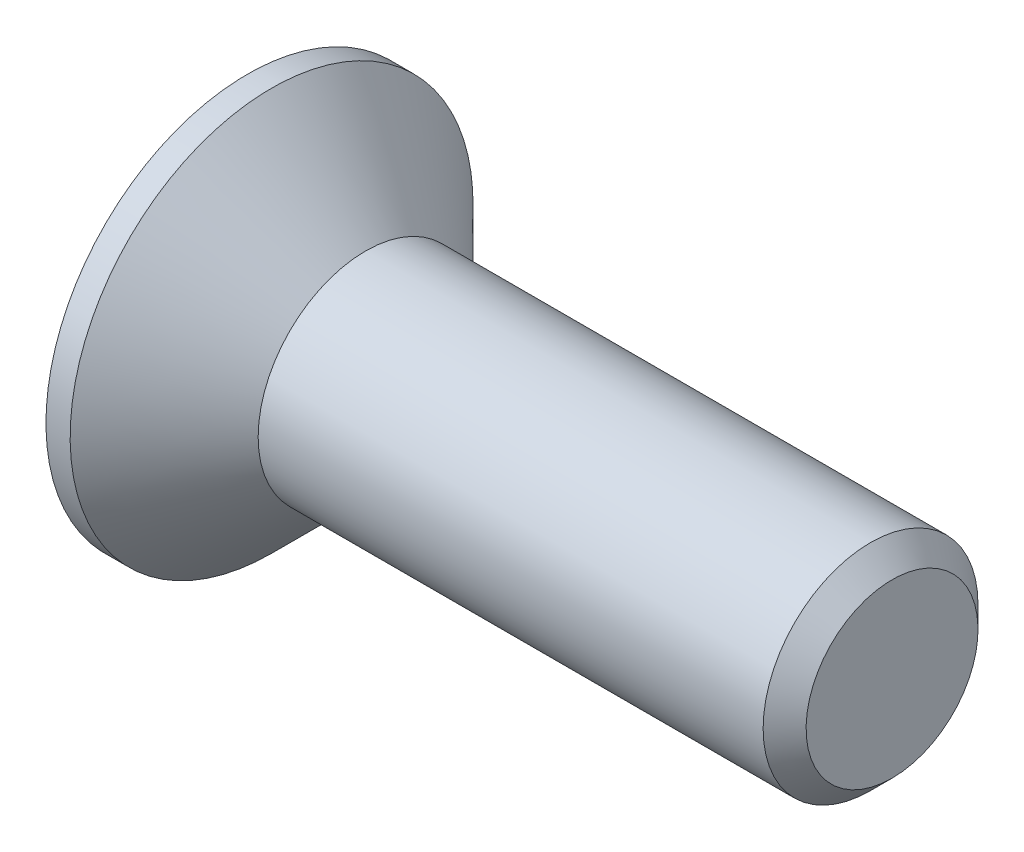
ISO-10303-21;
HEADER;
FILE_DESCRIPTION(('STEP AP214'),'2;1');
FILE_NAME('part.step','',(''),(''),'','','');
FILE_SCHEMA(('AUTOMOTIVE_DESIGN { 1 0 10303 214 1 1 1 1 }'));
ENDSEC;
DATA;
#1=APPLICATION_CONTEXT('core data for automotive mechanical design processes');
#2=APPLICATION_PROTOCOL_DEFINITION('international standard','automotive_design',2000,#1);
#3=PRODUCT_CONTEXT('',#1,'mechanical');
#4=PRODUCT('Part','Part','',(#3));
#5=PRODUCT_RELATED_PRODUCT_CATEGORY('part','',(#4));
#6=PRODUCT_DEFINITION_FORMATION('','',#4);
#7=PRODUCT_DEFINITION_CONTEXT('part definition',#1,'design');
#8=PRODUCT_DEFINITION('design','',#6,#7);
#9=PRODUCT_DEFINITION_SHAPE('','',#8);
#10=(LENGTH_UNIT() NAMED_UNIT(*) SI_UNIT(.MILLI.,.METRE.));
#11=(NAMED_UNIT(*) PLANE_ANGLE_UNIT() SI_UNIT($,.RADIAN.));
#12=(NAMED_UNIT(*) SI_UNIT($,.STERADIAN.) SOLID_ANGLE_UNIT());
#13=UNCERTAINTY_MEASURE_WITH_UNIT(LENGTH_MEASURE(1.E-05),#10,'distance_accuracy_value','');
#14=(GEOMETRIC_REPRESENTATION_CONTEXT(3) GLOBAL_UNCERTAINTY_ASSIGNED_CONTEXT((#13)) GLOBAL_UNIT_ASSIGNED_CONTEXT((#10,
#11,#12)) REPRESENTATION_CONTEXT('',''));
#15=CARTESIAN_POINT('',(0.,0.,0.));
#16=DIRECTION('',(0.,0.,1.));
#17=DIRECTION('',(1.,0.,0.));
#18=AXIS2_PLACEMENT_3D('',#15,#16,#17);
#19=CARTESIAN_POINT('',(0.,0.,0.));
#20=DIRECTION('',(-1.,0.,0.));
#21=DIRECTION('',(0.,-1.,0.));
#22=AXIS2_PLACEMENT_3D('',#19,#20,#21);
#23=CONICAL_SURFACE('',#22,2.,0.78539816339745);
#24=CARTESIAN_POINT('',(-1.74999999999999,0.,0.));
#25=DIRECTION('',(-1.,0.,0.));
#26=DIRECTION('',(0.,-1.,0.));
#27=AXIS2_PLACEMENT_3D('',#24,#25,#26);
#28=CIRCLE('',#27,3.75);
#29=CARTESIAN_POINT('',(-1.74999999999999,-3.75,0.));
#30=VERTEX_POINT('',#29);
#31=EDGE_CURVE('E189',#30,#30,#28,.T.);
#32=ORIENTED_EDGE('',*,*,#31,.F.);
#33=EDGE_LOOP('',(#32));
#34=FACE_BOUND('',#33,.T.);
#35=CARTESIAN_POINT('',(0.,0.,0.));
#36=DIRECTION('',(-1.,0.,0.));
#37=DIRECTION('',(0.,-1.,0.));
#38=AXIS2_PLACEMENT_3D('',#35,#36,#37);
#39=CIRCLE('',#38,2.);
#40=CARTESIAN_POINT('',(0.,-2.,0.));
#41=VERTEX_POINT('',#40);
#42=EDGE_CURVE('E212',#41,#41,#39,.T.);
#43=ORIENTED_EDGE('',*,*,#42,.T.);
#44=EDGE_LOOP('',(#43));
#45=FACE_BOUND('',#44,.T.);
#46=ADVANCED_FACE('F33',(#34,#45),#23,.T.);
#47=CARTESIAN_POINT('',(-2.2,0.,0.));
#48=DIRECTION('',(-1.,0.,0.));
#49=DIRECTION('',(0.,-1.,0.));
#50=AXIS2_PLACEMENT_3D('',#47,#48,#49);
#51=CYLINDRICAL_SURFACE('',#50,2.);
#52=CARTESIAN_POINT('',(9.4,0.,0.));
#53=DIRECTION('',(-1.,0.,0.));
#54=DIRECTION('',(0.,-1.,0.));
#55=AXIS2_PLACEMENT_3D('',#52,#53,#54);
#56=CIRCLE('',#55,2.);
#57=CARTESIAN_POINT('',(9.4,-2.,0.));
#58=VERTEX_POINT('',#57);
#59=EDGE_CURVE('E41',#58,#58,#56,.T.);
#60=ORIENTED_EDGE('',*,*,#59,.T.);
#61=EDGE_LOOP('',(#60));
#62=FACE_BOUND('',#61,.T.);
#63=ORIENTED_EDGE('',*,*,#42,.F.);
#64=EDGE_LOOP('',(#63));
#65=FACE_BOUND('',#64,.T.);
#66=ADVANCED_FACE('F217',(#62,#65),#51,.T.);
#67=CARTESIAN_POINT('',(9.8,0.,0.));
#68=DIRECTION('',(-1.,0.,0.));
#69=DIRECTION('',(0.,-1.,0.));
#70=AXIS2_PLACEMENT_3D('',#67,#68,#69);
#71=PLANE('',#70);
#72=CARTESIAN_POINT('',(9.8,0.,0.));
#73=DIRECTION('',(-1.,0.,0.));
#74=DIRECTION('',(0.,-1.,0.));
#75=AXIS2_PLACEMENT_3D('',#72,#73,#74);
#76=CIRCLE('',#75,1.6);
#77=CARTESIAN_POINT('',(9.8,-1.6,0.));
#78=VERTEX_POINT('',#77);
#79=EDGE_CURVE('E11',#78,#78,#76,.F.);
#80=ORIENTED_EDGE('',*,*,#79,.T.);
#81=EDGE_LOOP('',(#80));
#82=FACE_BOUND('',#81,.T.);
#83=ADVANCED_FACE('F239',(#82),#71,.F.);
#84=CARTESIAN_POINT('',(-2.2,3.75,0.));
#85=DIRECTION('',(1.,0.,0.));
#86=DIRECTION('',(0.,1.,0.));
#87=AXIS2_PLACEMENT_3D('',#84,#85,#86);
#88=PLANE('',#87);
#89=DIRECTION('',(0.,0.,-1.));
#90=VECTOR('',#89,1.);
#91=CARTESIAN_POINT('',(-2.2,0.55,-2.2));
#92=LINE('',#91,#90);
#93=CARTESIAN_POINT('',(-2.2,0.55,-0.55));
#94=VERTEX_POINT('',#93);
#95=CARTESIAN_POINT('',(-2.2,0.55,-2.2));
#96=VERTEX_POINT('',#95);
#97=EDGE_CURVE('E158',#94,#96,#92,.T.);
#98=ORIENTED_EDGE('',*,*,#97,.F.);
#99=DIRECTION('',(0.,-1.,0.));
#100=VECTOR('',#99,1.);
#101=CARTESIAN_POINT('',(-2.2,0.55,-0.55));
#102=LINE('',#101,#100);
#103=CARTESIAN_POINT('',(-2.2,2.2,-0.55));
#104=VERTEX_POINT('',#103);
#105=EDGE_CURVE('E48',#104,#94,#102,.T.);
#106=ORIENTED_EDGE('',*,*,#105,.F.);
#107=DIRECTION('',(0.,0.,-1.));
#108=VECTOR('',#107,1.);
#109=CARTESIAN_POINT('',(-2.2,2.2,-0.55));
#110=LINE('',#109,#108);
#111=CARTESIAN_POINT('',(-2.2,2.2,0.55));
#112=VERTEX_POINT('',#111);
#113=EDGE_CURVE('E185',#112,#104,#110,.T.);
#114=ORIENTED_EDGE('',*,*,#113,.F.);
#115=DIRECTION('',(0.,1.,0.));
#116=VECTOR('',#115,1.);
#117=CARTESIAN_POINT('',(-2.2,2.2,0.55));
#118=LINE('',#117,#116);
#119=CARTESIAN_POINT('',(-2.2,0.55,0.55));
#120=VERTEX_POINT('',#119);
#121=EDGE_CURVE('E183',#120,#112,#118,.T.);
#122=ORIENTED_EDGE('',*,*,#121,.F.);
#123=DIRECTION('',(0.,0.,-1.));
#124=VECTOR('',#123,1.);
#125=CARTESIAN_POINT('',(-2.2,0.55,0.55));
#126=LINE('',#125,#124);
#127=CARTESIAN_POINT('',(-2.2,0.55,2.2));
#128=VERTEX_POINT('',#127);
#129=EDGE_CURVE('E132',#128,#120,#126,.T.);
#130=ORIENTED_EDGE('',*,*,#129,.F.);
#131=DIRECTION('',(0.,1.,0.));
#132=VECTOR('',#131,1.);
#133=CARTESIAN_POINT('',(-2.2,0.55,2.2));
#134=LINE('',#133,#132);
#135=CARTESIAN_POINT('',(-2.2,-0.55,2.2));
#136=VERTEX_POINT('',#135);
#137=EDGE_CURVE('E179',#136,#128,#134,.T.);
#138=ORIENTED_EDGE('',*,*,#137,.F.);
#139=DIRECTION('',(0.,0.,1.));
#140=VECTOR('',#139,1.);
#141=CARTESIAN_POINT('',(-2.2,-0.55,2.2));
#142=LINE('',#141,#140);
#143=CARTESIAN_POINT('',(-2.2,-0.55,0.55));
#144=VERTEX_POINT('',#143);
#145=EDGE_CURVE('E176',#144,#136,#142,.T.);
#146=ORIENTED_EDGE('',*,*,#145,.F.);
#147=DIRECTION('',(0.,1.,0.));
#148=VECTOR('',#147,1.);
#149=CARTESIAN_POINT('',(-2.2,-0.55,0.55));
#150=LINE('',#149,#148);
#151=CARTESIAN_POINT('',(-2.2,-2.2,0.55));
#152=VERTEX_POINT('',#151);
#153=EDGE_CURVE('E173',#152,#144,#150,.T.);
#154=ORIENTED_EDGE('',*,*,#153,.F.);
#155=DIRECTION('',(0.,0.,1.));
#156=VECTOR('',#155,1.);
#157=CARTESIAN_POINT('',(-2.2,-2.2,0.55));
#158=LINE('',#157,#156);
#159=CARTESIAN_POINT('',(-2.2,-2.2,-0.55));
#160=VERTEX_POINT('',#159);
#161=EDGE_CURVE('E170',#160,#152,#158,.T.);
#162=ORIENTED_EDGE('',*,*,#161,.F.);
#163=DIRECTION('',(0.,-1.,0.));
#164=VECTOR('',#163,1.);
#165=CARTESIAN_POINT('',(-2.2,-2.2,-0.55));
#166=LINE('',#165,#164);
#167=CARTESIAN_POINT('',(-2.2,-0.55,-0.55));
#168=VERTEX_POINT('',#167);
#169=EDGE_CURVE('E167',#168,#160,#166,.T.);
#170=ORIENTED_EDGE('',*,*,#169,.F.);
#171=DIRECTION('',(0.,0.,1.));
#172=VECTOR('',#171,1.);
#173=CARTESIAN_POINT('',(-2.2,-0.55,-0.55));
#174=LINE('',#173,#172);
#175=CARTESIAN_POINT('',(-2.2,-0.55,-2.2));
#176=VERTEX_POINT('',#175);
#177=EDGE_CURVE('E164',#176,#168,#174,.T.);
#178=ORIENTED_EDGE('',*,*,#177,.F.);
#179=DIRECTION('',(0.,-1.,0.));
#180=VECTOR('',#179,1.);
#181=CARTESIAN_POINT('',(-2.2,-0.55,-2.2));
#182=LINE('',#181,#180);
#183=EDGE_CURVE('E161',#96,#176,#182,.T.);
#184=ORIENTED_EDGE('',*,*,#183,.F.);
#185=EDGE_LOOP('',(#98,#106,#114,#122,#130,#138,#146,#154,#162,#170,#178,#184));
#186=FACE_BOUND('',#185,.T.);
#187=CARTESIAN_POINT('',(-2.2,0.,0.));
#188=DIRECTION('',(-1.,0.,0.));
#189=DIRECTION('',(0.,-1.,0.));
#190=AXIS2_PLACEMENT_3D('',#187,#188,#189);
#191=CIRCLE('',#190,3.75);
#192=CARTESIAN_POINT('',(-2.2,-3.75,0.));
#193=VERTEX_POINT('',#192);
#194=EDGE_CURVE('E209',#193,#193,#191,.T.);
#195=ORIENTED_EDGE('',*,*,#194,.T.);
#196=EDGE_LOOP('',(#195));
#197=FACE_BOUND('',#196,.T.);
#198=ADVANCED_FACE('F230',(#186,#197),#88,.F.);
#199=CARTESIAN_POINT('',(-2.2,0.,0.));
#200=DIRECTION('',(-1.,0.,0.));
#201=DIRECTION('',(0.,-1.,0.));
#202=AXIS2_PLACEMENT_3D('',#199,#200,#201);
#203=CYLINDRICAL_SURFACE('',#202,3.75);
#204=ORIENTED_EDGE('',*,*,#194,.F.);
#205=EDGE_LOOP('',(#204));
#206=FACE_BOUND('',#205,.T.);
#207=ORIENTED_EDGE('',*,*,#31,.T.);
#208=EDGE_LOOP('',(#207));
#209=FACE_BOUND('',#208,.T.);
#210=ADVANCED_FACE('F222',(#206,#209),#203,.T.);
#211=CARTESIAN_POINT('',(9.4,0.,0.));
#212=DIRECTION('',(-1.,0.,0.));
#213=DIRECTION('',(0.,-1.,0.));
#214=AXIS2_PLACEMENT_3D('',#211,#212,#213);
#215=CONICAL_SURFACE('',#214,2.,0.785398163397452);
#216=ORIENTED_EDGE('',*,*,#79,.F.);
#217=EDGE_LOOP('',(#216));
#218=FACE_BOUND('',#217,.T.);
#219=ORIENTED_EDGE('',*,*,#59,.F.);
#220=EDGE_LOOP('',(#219));
#221=FACE_BOUND('',#220,.T.);
#222=ADVANCED_FACE('F35',(#218,#221),#215,.T.);
#223=CARTESIAN_POINT('',(-0.3,0.55,-0.55));
#224=DIRECTION('',(0.,0.,-1.));
#225=DIRECTION('',(-1.,0.,0.));
#226=AXIS2_PLACEMENT_3D('',#223,#224,#225);
#227=PLANE('',#226);
#228=ORIENTED_EDGE('',*,*,#105,.T.);
#229=DIRECTION('',(-1.,0.,0.));
#230=VECTOR('',#229,1.);
#231=CARTESIAN_POINT('',(-0.3,0.55,-0.55));
#232=LINE('',#231,#230);
#233=CARTESIAN_POINT('',(-0.3,0.55,-0.55));
#234=VERTEX_POINT('',#233);
#235=EDGE_CURVE('E96',#234,#94,#232,.T.);
#236=ORIENTED_EDGE('',*,*,#235,.F.);
#237=DIRECTION('',(0.,-1.,0.));
#238=VECTOR('',#237,1.);
#239=CARTESIAN_POINT('',(-0.3,0.55,-0.55));
#240=LINE('',#239,#238);
#241=CARTESIAN_POINT('',(-0.3,2.2,-0.55));
#242=VERTEX_POINT('',#241);
#243=EDGE_CURVE('E187',#242,#234,#240,.T.);
#244=ORIENTED_EDGE('',*,*,#243,.F.);
#245=DIRECTION('',(-1.,0.,0.));
#246=VECTOR('',#245,1.);
#247=CARTESIAN_POINT('',(-0.3,2.2,-0.55));
#248=LINE('',#247,#246);
#249=EDGE_CURVE('E56',#242,#104,#248,.T.);
#250=ORIENTED_EDGE('',*,*,#249,.T.);
#251=EDGE_LOOP('',(#228,#236,#244,#250));
#252=FACE_BOUND('',#251,.T.);
#253=ADVANCED_FACE('F221',(#252),#227,.F.);
#254=CARTESIAN_POINT('',(-0.3,2.2,-0.55));
#255=DIRECTION('',(0.,1.,0.));
#256=DIRECTION('',(-1.,0.,0.));
#257=AXIS2_PLACEMENT_3D('',#254,#255,#256);
#258=PLANE('',#257);
#259=ORIENTED_EDGE('',*,*,#113,.T.);
#260=ORIENTED_EDGE('',*,*,#249,.F.);
#261=DIRECTION('',(0.,0.,-1.));
#262=VECTOR('',#261,1.);
#263=CARTESIAN_POINT('',(-0.3,2.2,-0.55));
#264=LINE('',#263,#262);
#265=CARTESIAN_POINT('',(-0.3,2.2,0.55));
#266=VERTEX_POINT('',#265);
#267=EDGE_CURVE('E144',#266,#242,#264,.T.);
#268=ORIENTED_EDGE('',*,*,#267,.F.);
#269=DIRECTION('',(-1.,0.,0.));
#270=VECTOR('',#269,1.);
#271=CARTESIAN_POINT('',(-0.3,2.2,0.55));
#272=LINE('',#271,#270);
#273=EDGE_CURVE('E136',#266,#112,#272,.T.);
#274=ORIENTED_EDGE('',*,*,#273,.T.);
#275=EDGE_LOOP('',(#259,#260,#268,#274));
#276=FACE_BOUND('',#275,.T.);
#277=ADVANCED_FACE('F228',(#276),#258,.F.);
#278=CARTESIAN_POINT('',(-0.3,2.2,0.55));
#279=DIRECTION('',(0.,0.,1.));
#280=DIRECTION('',(1.,0.,0.));
#281=AXIS2_PLACEMENT_3D('',#278,#279,#280);
#282=PLANE('',#281);
#283=ORIENTED_EDGE('',*,*,#121,.T.);
#284=ORIENTED_EDGE('',*,*,#273,.F.);
#285=DIRECTION('',(0.,1.,0.));
#286=VECTOR('',#285,1.);
#287=CARTESIAN_POINT('',(-0.3,2.2,0.55));
#288=LINE('',#287,#286);
#289=CARTESIAN_POINT('',(-0.3,0.55,0.55));
#290=VERTEX_POINT('',#289);
#291=EDGE_CURVE('E140',#290,#266,#288,.T.);
#292=ORIENTED_EDGE('',*,*,#291,.F.);
#293=DIRECTION('',(-1.,0.,0.));
#294=VECTOR('',#293,1.);
#295=CARTESIAN_POINT('',(-0.3,0.55,0.55));
#296=LINE('',#295,#294);
#297=EDGE_CURVE('E125',#290,#120,#296,.T.);
#298=ORIENTED_EDGE('',*,*,#297,.T.);
#299=EDGE_LOOP('',(#283,#284,#292,#298));
#300=FACE_BOUND('',#299,.T.);
#301=ADVANCED_FACE('F141',(#300),#282,.F.);
#302=CARTESIAN_POINT('',(-0.3,0.55,0.55));
#303=DIRECTION('',(0.,1.,0.));
#304=DIRECTION('',(-1.,0.,0.));
#305=AXIS2_PLACEMENT_3D('',#302,#303,#304);
#306=PLANE('',#305);
#307=ORIENTED_EDGE('',*,*,#129,.T.);
#308=ORIENTED_EDGE('',*,*,#297,.F.);
#309=DIRECTION('',(0.,0.,-1.));
#310=VECTOR('',#309,1.);
#311=CARTESIAN_POINT('',(-0.3,0.55,0.55));
#312=LINE('',#311,#310);
#313=CARTESIAN_POINT('',(-0.3,0.55,2.2));
#314=VERTEX_POINT('',#313);
#315=EDGE_CURVE('E129',#314,#290,#312,.T.);
#316=ORIENTED_EDGE('',*,*,#315,.F.);
#317=DIRECTION('',(-1.,0.,0.));
#318=VECTOR('',#317,1.);
#319=CARTESIAN_POINT('',(-0.3,0.55,2.2));
#320=LINE('',#319,#318);
#321=EDGE_CURVE('E137',#314,#128,#320,.T.);
#322=ORIENTED_EDGE('',*,*,#321,.T.);
#323=EDGE_LOOP('',(#307,#308,#316,#322));
#324=FACE_BOUND('',#323,.T.);
#325=ADVANCED_FACE('F127',(#324),#306,.F.);
#326=CARTESIAN_POINT('',(-0.3,0.55,2.2));
#327=DIRECTION('',(0.,0.,1.));
#328=DIRECTION('',(1.,0.,0.));
#329=AXIS2_PLACEMENT_3D('',#326,#327,#328);
#330=PLANE('',#329);
#331=ORIENTED_EDGE('',*,*,#137,.T.);
#332=ORIENTED_EDGE('',*,*,#321,.F.);
#333=DIRECTION('',(0.,1.,0.));
#334=VECTOR('',#333,1.);
#335=CARTESIAN_POINT('',(-0.3,0.55,2.2));
#336=LINE('',#335,#334);
#337=CARTESIAN_POINT('',(-0.3,-0.55,2.2));
#338=VERTEX_POINT('',#337);
#339=EDGE_CURVE('E150',#338,#314,#336,.T.);
#340=ORIENTED_EDGE('',*,*,#339,.F.);
#341=DIRECTION('',(-1.,0.,0.));
#342=VECTOR('',#341,1.);
#343=CARTESIAN_POINT('',(-0.3,-0.55,2.2));
#344=LINE('',#343,#342);
#345=EDGE_CURVE('E192',#338,#136,#344,.T.);
#346=ORIENTED_EDGE('',*,*,#345,.T.);
#347=EDGE_LOOP('',(#331,#332,#340,#346));
#348=FACE_BOUND('',#347,.T.);
#349=ADVANCED_FACE('F277',(#348),#330,.F.);
#350=CARTESIAN_POINT('',(-0.3,-0.55,2.2));
#351=DIRECTION('',(0.,-1.,0.));
#352=DIRECTION('',(1.,0.,0.));
#353=AXIS2_PLACEMENT_3D('',#350,#351,#352);
#354=PLANE('',#353);
#355=ORIENTED_EDGE('',*,*,#145,.T.);
#356=ORIENTED_EDGE('',*,*,#345,.F.);
#357=DIRECTION('',(0.,0.,1.));
#358=VECTOR('',#357,1.);
#359=CARTESIAN_POINT('',(-0.3,-0.55,2.2));
#360=LINE('',#359,#358);
#361=CARTESIAN_POINT('',(-0.3,-0.55,0.55));
#362=VERTEX_POINT('',#361);
#363=EDGE_CURVE('E152',#362,#338,#360,.T.);
#364=ORIENTED_EDGE('',*,*,#363,.F.);
#365=DIRECTION('',(-1.,0.,0.));
#366=VECTOR('',#365,1.);
#367=CARTESIAN_POINT('',(-0.3,-0.55,0.55));
#368=LINE('',#367,#366);
#369=EDGE_CURVE('E194',#362,#144,#368,.T.);
#370=ORIENTED_EDGE('',*,*,#369,.T.);
#371=EDGE_LOOP('',(#355,#356,#364,#370));
#372=FACE_BOUND('',#371,.T.);
#373=ADVANCED_FACE('F273',(#372),#354,.F.);
#374=CARTESIAN_POINT('',(-0.3,-0.55,0.55));
#375=DIRECTION('',(0.,0.,1.));
#376=DIRECTION('',(1.,0.,0.));
#377=AXIS2_PLACEMENT_3D('',#374,#375,#376);
#378=PLANE('',#377);
#379=ORIENTED_EDGE('',*,*,#153,.T.);
#380=ORIENTED_EDGE('',*,*,#369,.F.);
#381=DIRECTION('',(0.,1.,0.));
#382=VECTOR('',#381,1.);
#383=CARTESIAN_POINT('',(-0.3,-0.55,0.55));
#384=LINE('',#383,#382);
#385=CARTESIAN_POINT('',(-0.3,-2.2,0.55));
#386=VERTEX_POINT('',#385);
#387=EDGE_CURVE('E422',#386,#362,#384,.T.);
#388=ORIENTED_EDGE('',*,*,#387,.F.);
#389=DIRECTION('',(-1.,0.,0.));
#390=VECTOR('',#389,1.);
#391=CARTESIAN_POINT('',(-0.3,-2.2,0.55));
#392=LINE('',#391,#390);
#393=EDGE_CURVE('E196',#386,#152,#392,.T.);
#394=ORIENTED_EDGE('',*,*,#393,.T.);
#395=EDGE_LOOP('',(#379,#380,#388,#394));
#396=FACE_BOUND('',#395,.T.);
#397=ADVANCED_FACE('F269',(#396),#378,.F.);
#398=CARTESIAN_POINT('',(-0.3,-2.2,0.55));
#399=DIRECTION('',(0.,-1.,0.));
#400=DIRECTION('',(1.,0.,0.));
#401=AXIS2_PLACEMENT_3D('',#398,#399,#400);
#402=PLANE('',#401);
#403=ORIENTED_EDGE('',*,*,#161,.T.);
#404=ORIENTED_EDGE('',*,*,#393,.F.);
#405=DIRECTION('',(0.,0.,1.));
#406=VECTOR('',#405,1.);
#407=CARTESIAN_POINT('',(-0.3,-2.2,0.55));
#408=LINE('',#407,#406);
#409=CARTESIAN_POINT('',(-0.3,-2.2,-0.55));
#410=VERTEX_POINT('',#409);
#411=EDGE_CURVE('E419',#410,#386,#408,.T.);
#412=ORIENTED_EDGE('',*,*,#411,.F.);
#413=DIRECTION('',(-1.,0.,0.));
#414=VECTOR('',#413,1.);
#415=CARTESIAN_POINT('',(-0.3,-2.2,-0.55));
#416=LINE('',#415,#414);
#417=EDGE_CURVE('E198',#410,#160,#416,.T.);
#418=ORIENTED_EDGE('',*,*,#417,.T.);
#419=EDGE_LOOP('',(#403,#404,#412,#418));
#420=FACE_BOUND('',#419,.T.);
#421=ADVANCED_FACE('F265',(#420),#402,.F.);
#422=CARTESIAN_POINT('',(-0.3,-2.2,-0.55));
#423=DIRECTION('',(0.,0.,-1.));
#424=DIRECTION('',(-1.,0.,0.));
#425=AXIS2_PLACEMENT_3D('',#422,#423,#424);
#426=PLANE('',#425);
#427=ORIENTED_EDGE('',*,*,#169,.T.);
#428=ORIENTED_EDGE('',*,*,#417,.F.);
#429=DIRECTION('',(0.,-1.,0.));
#430=VECTOR('',#429,1.);
#431=CARTESIAN_POINT('',(-0.3,-2.2,-0.55));
#432=LINE('',#431,#430);
#433=CARTESIAN_POINT('',(-0.3,-0.55,-0.55));
#434=VERTEX_POINT('',#433);
#435=EDGE_CURVE('E416',#434,#410,#432,.T.);
#436=ORIENTED_EDGE('',*,*,#435,.F.);
#437=DIRECTION('',(-1.,0.,0.));
#438=VECTOR('',#437,1.);
#439=CARTESIAN_POINT('',(-0.3,-0.55,-0.55));
#440=LINE('',#439,#438);
#441=EDGE_CURVE('E200',#434,#168,#440,.T.);
#442=ORIENTED_EDGE('',*,*,#441,.T.);
#443=EDGE_LOOP('',(#427,#428,#436,#442));
#444=FACE_BOUND('',#443,.T.);
#445=ADVANCED_FACE('F261',(#444),#426,.F.);
#446=CARTESIAN_POINT('',(-0.3,-0.55,-0.55));
#447=DIRECTION('',(0.,-1.,0.));
#448=DIRECTION('',(1.,0.,0.));
#449=AXIS2_PLACEMENT_3D('',#446,#447,#448);
#450=PLANE('',#449);
#451=ORIENTED_EDGE('',*,*,#177,.T.);
#452=ORIENTED_EDGE('',*,*,#441,.F.);
#453=DIRECTION('',(0.,0.,1.));
#454=VECTOR('',#453,1.);
#455=CARTESIAN_POINT('',(-0.3,-0.55,-0.55));
#456=LINE('',#455,#454);
#457=CARTESIAN_POINT('',(-0.3,-0.55,-2.2));
#458=VERTEX_POINT('',#457);
#459=EDGE_CURVE('E413',#458,#434,#456,.T.);
#460=ORIENTED_EDGE('',*,*,#459,.F.);
#461=DIRECTION('',(-1.,0.,0.));
#462=VECTOR('',#461,1.);
#463=CARTESIAN_POINT('',(-0.3,-0.55,-2.2));
#464=LINE('',#463,#462);
#465=EDGE_CURVE('E202',#458,#176,#464,.T.);
#466=ORIENTED_EDGE('',*,*,#465,.T.);
#467=EDGE_LOOP('',(#451,#452,#460,#466));
#468=FACE_BOUND('',#467,.T.);
#469=ADVANCED_FACE('F257',(#468),#450,.F.);
#470=CARTESIAN_POINT('',(-0.3,-0.55,-2.2));
#471=DIRECTION('',(0.,0.,-1.));
#472=DIRECTION('',(-1.,0.,0.));
#473=AXIS2_PLACEMENT_3D('',#470,#471,#472);
#474=PLANE('',#473);
#475=ORIENTED_EDGE('',*,*,#183,.T.);
#476=ORIENTED_EDGE('',*,*,#465,.F.);
#477=DIRECTION('',(0.,-1.,0.));
#478=VECTOR('',#477,1.);
#479=CARTESIAN_POINT('',(-0.3,-0.55,-2.2));
#480=LINE('',#479,#478);
#481=CARTESIAN_POINT('',(-0.3,0.55,-2.2));
#482=VERTEX_POINT('',#481);
#483=EDGE_CURVE('E408',#482,#458,#480,.T.);
#484=ORIENTED_EDGE('',*,*,#483,.F.);
#485=DIRECTION('',(-1.,0.,0.));
#486=VECTOR('',#485,1.);
#487=CARTESIAN_POINT('',(-0.3,0.55,-2.2));
#488=LINE('',#487,#486);
#489=EDGE_CURVE('E204',#482,#96,#488,.T.);
#490=ORIENTED_EDGE('',*,*,#489,.T.);
#491=EDGE_LOOP('',(#475,#476,#484,#490));
#492=FACE_BOUND('',#491,.T.);
#493=ADVANCED_FACE('F253',(#492),#474,.F.);
#494=CARTESIAN_POINT('',(-0.3,0.55,-2.2));
#495=DIRECTION('',(0.,1.,0.));
#496=DIRECTION('',(-1.,0.,0.));
#497=AXIS2_PLACEMENT_3D('',#494,#495,#496);
#498=PLANE('',#497);
#499=ORIENTED_EDGE('',*,*,#97,.T.);
#500=ORIENTED_EDGE('',*,*,#489,.F.);
#501=DIRECTION('',(0.,0.,-1.));
#502=VECTOR('',#501,1.);
#503=CARTESIAN_POINT('',(-0.3,0.55,-2.2));
#504=LINE('',#503,#502);
#505=EDGE_CURVE('E406',#234,#482,#504,.T.);
#506=ORIENTED_EDGE('',*,*,#505,.F.);
#507=ORIENTED_EDGE('',*,*,#235,.T.);
#508=EDGE_LOOP('',(#499,#500,#506,#507));
#509=FACE_BOUND('',#508,.T.);
#510=ADVANCED_FACE('F250',(#509),#498,.F.);
#511=CARTESIAN_POINT('',(-0.3,0.,0.));
#512=DIRECTION('',(1.,0.,0.));
#513=DIRECTION('',(0.,0.,-1.));
#514=AXIS2_PLACEMENT_3D('',#511,#512,#513);
#515=PLANE('',#514);
#516=ORIENTED_EDGE('',*,*,#243,.T.);
#517=ORIENTED_EDGE('',*,*,#505,.T.);
#518=ORIENTED_EDGE('',*,*,#483,.T.);
#519=ORIENTED_EDGE('',*,*,#459,.T.);
#520=ORIENTED_EDGE('',*,*,#435,.T.);
#521=ORIENTED_EDGE('',*,*,#411,.T.);
#522=ORIENTED_EDGE('',*,*,#387,.T.);
#523=ORIENTED_EDGE('',*,*,#363,.T.);
#524=ORIENTED_EDGE('',*,*,#339,.T.);
#525=ORIENTED_EDGE('',*,*,#315,.T.);
#526=ORIENTED_EDGE('',*,*,#291,.T.);
#527=ORIENTED_EDGE('',*,*,#267,.T.);
#528=EDGE_LOOP('',(#516,#517,#518,#519,#520,#521,#522,#523,#524,#525,#526,#527));
#529=FACE_BOUND('',#528,.T.);
#530=ADVANCED_FACE('F147',(#529),#515,.F.);
#531=CLOSED_SHELL('',(#46,#66,#83,#198,#210,#222,#253,#277,#301,#325,#349,#373,#397,#421,#445,
#469,#493,#510,#530));
#532=MANIFOLD_SOLID_BREP('B2',#531);
#533=ADVANCED_BREP_SHAPE_REPRESENTATION('',(#18,#532),#14);
#534=SHAPE_DEFINITION_REPRESENTATION(#9,#533);
ENDSEC;
END-ISO-10303-21;
